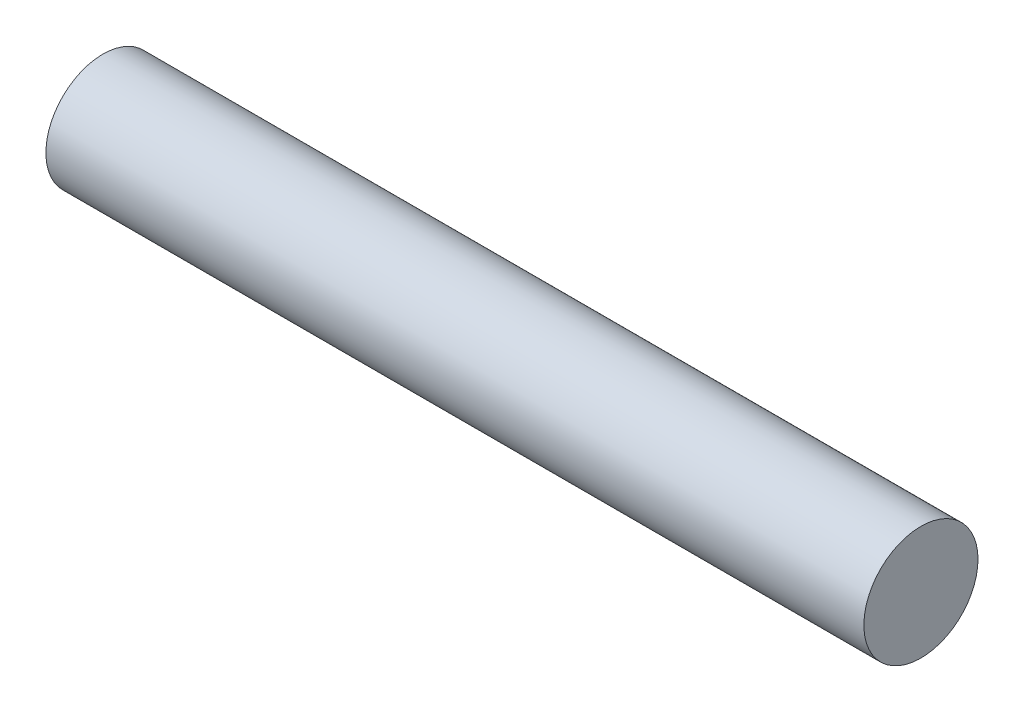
ISO-10303-21;
HEADER;
FILE_DESCRIPTION(('STEP AP214'),'2;1');
FILE_NAME('part.step','',(''),(''),'','','');
FILE_SCHEMA(('AUTOMOTIVE_DESIGN { 1 0 10303 214 1 1 1 1 }'));
ENDSEC;
DATA;
#1=APPLICATION_CONTEXT('core data for automotive mechanical design processes');
#2=APPLICATION_PROTOCOL_DEFINITION('international standard','automotive_design',2000,#1);
#3=PRODUCT_CONTEXT('',#1,'mechanical');
#4=PRODUCT('Part','Part','',(#3));
#5=PRODUCT_RELATED_PRODUCT_CATEGORY('part','',(#4));
#6=PRODUCT_DEFINITION_FORMATION('','',#4);
#7=PRODUCT_DEFINITION_CONTEXT('part definition',#1,'design');
#8=PRODUCT_DEFINITION('design','',#6,#7);
#9=PRODUCT_DEFINITION_SHAPE('','',#8);
#10=(LENGTH_UNIT() NAMED_UNIT(*) SI_UNIT(.MILLI.,.METRE.));
#11=(NAMED_UNIT(*) PLANE_ANGLE_UNIT() SI_UNIT($,.RADIAN.));
#12=(NAMED_UNIT(*) SI_UNIT($,.STERADIAN.) SOLID_ANGLE_UNIT());
#13=UNCERTAINTY_MEASURE_WITH_UNIT(LENGTH_MEASURE(1.E-05),#10,'distance_accuracy_value','');
#14=(GEOMETRIC_REPRESENTATION_CONTEXT(3) GLOBAL_UNCERTAINTY_ASSIGNED_CONTEXT((#13)) GLOBAL_UNIT_ASSIGNED_CONTEXT((#10,
#11,#12)) REPRESENTATION_CONTEXT('',''));
#15=CARTESIAN_POINT('',(0.,0.,0.));
#16=DIRECTION('',(0.,0.,1.));
#17=DIRECTION('',(1.,0.,0.));
#18=AXIS2_PLACEMENT_3D('',#15,#16,#17);
#19=CARTESIAN_POINT('',(172.,0.,0.));
#20=DIRECTION('',(-1.,0.,0.));
#21=DIRECTION('',(0.,0.,1.));
#22=AXIS2_PLACEMENT_3D('',#19,#20,#21);
#23=CYLINDRICAL_SURFACE('',#22,12.);
#24=CARTESIAN_POINT('',(172.,0.,0.));
#25=DIRECTION('',(1.,0.,0.));
#26=DIRECTION('',(0.,0.,-1.));
#27=AXIS2_PLACEMENT_3D('',#24,#25,#26);
#28=CIRCLE('',#27,12.);
#29=CARTESIAN_POINT('',(172.,0.,-12.));
#30=VERTEX_POINT('',#29);
#31=EDGE_CURVE('E10',#30,#30,#28,.T.);
#32=ORIENTED_EDGE('',*,*,#31,.F.);
#33=EDGE_LOOP('',(#32));
#34=FACE_BOUND('',#33,.T.);
#35=CARTESIAN_POINT('',(0.,0.,0.));
#36=DIRECTION('',(1.,0.,0.));
#37=DIRECTION('',(0.,0.,-1.));
#38=AXIS2_PLACEMENT_3D('',#35,#36,#37);
#39=CIRCLE('',#38,12.);
#40=CARTESIAN_POINT('',(0.,0.,-12.));
#41=VERTEX_POINT('',#40);
#42=EDGE_CURVE('E32',#41,#41,#39,.T.);
#43=ORIENTED_EDGE('',*,*,#42,.T.);
#44=EDGE_LOOP('',(#43));
#45=FACE_BOUND('',#44,.T.);
#46=ADVANCED_FACE('F29',(#34,#45),#23,.T.);
#47=CARTESIAN_POINT('',(172.,0.,0.));
#48=DIRECTION('',(1.,0.,0.));
#49=DIRECTION('',(0.,0.,-1.));
#50=AXIS2_PLACEMENT_3D('',#47,#48,#49);
#51=PLANE('',#50);
#52=ORIENTED_EDGE('',*,*,#31,.T.);
#53=EDGE_LOOP('',(#52));
#54=FACE_BOUND('',#53,.T.);
#55=ADVANCED_FACE('F44',(#54),#51,.T.);
#56=CARTESIAN_POINT('',(0.,0.,0.));
#57=DIRECTION('',(1.,0.,0.));
#58=DIRECTION('',(0.,0.,-1.));
#59=AXIS2_PLACEMENT_3D('',#56,#57,#58);
#60=PLANE('',#59);
#61=ORIENTED_EDGE('',*,*,#42,.F.);
#62=EDGE_LOOP('',(#61));
#63=FACE_BOUND('',#62,.T.);
#64=ADVANCED_FACE('F42',(#63),#60,.F.);
#65=CLOSED_SHELL('',(#46,#55,#64));
#66=MANIFOLD_SOLID_BREP('B2',#65);
#67=ADVANCED_BREP_SHAPE_REPRESENTATION('',(#18,#66),#14);
#68=SHAPE_DEFINITION_REPRESENTATION(#9,#67);
ENDSEC;
END-ISO-10303-21;
